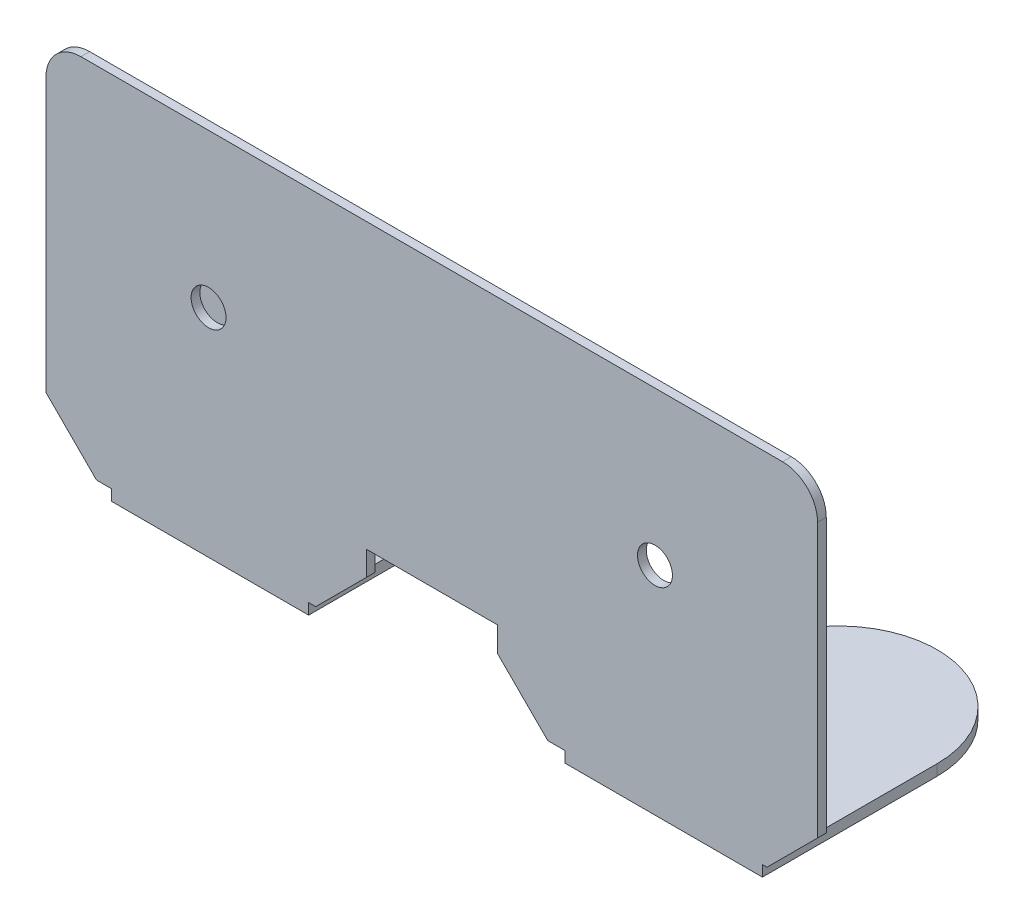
ISO-10303-21;
HEADER;
FILE_DESCRIPTION(('STEP AP214'),'2;1');
FILE_NAME('part.step','',(''),(''),'','','');
FILE_SCHEMA(('AUTOMOTIVE_DESIGN { 1 0 10303 214 1 1 1 1 }'));
ENDSEC;
DATA;
#1=APPLICATION_CONTEXT('core data for automotive mechanical design processes');
#2=APPLICATION_PROTOCOL_DEFINITION('international standard','automotive_design',2000,#1);
#3=PRODUCT_CONTEXT('',#1,'mechanical');
#4=PRODUCT('Part','Part','',(#3));
#5=PRODUCT_RELATED_PRODUCT_CATEGORY('part','',(#4));
#6=PRODUCT_DEFINITION_FORMATION('','',#4);
#7=PRODUCT_DEFINITION_CONTEXT('part definition',#1,'design');
#8=PRODUCT_DEFINITION('design','',#6,#7);
#9=PRODUCT_DEFINITION_SHAPE('','',#8);
#10=(LENGTH_UNIT() NAMED_UNIT(*) SI_UNIT(.MILLI.,.METRE.));
#11=(NAMED_UNIT(*) PLANE_ANGLE_UNIT() SI_UNIT($,.RADIAN.));
#12=(NAMED_UNIT(*) SI_UNIT($,.STERADIAN.) SOLID_ANGLE_UNIT());
#13=UNCERTAINTY_MEASURE_WITH_UNIT(LENGTH_MEASURE(1.E-05),#10,'distance_accuracy_value','');
#14=(GEOMETRIC_REPRESENTATION_CONTEXT(3) GLOBAL_UNCERTAINTY_ASSIGNED_CONTEXT((#13)) GLOBAL_UNIT_ASSIGNED_CONTEXT((#10,
#11,#12)) REPRESENTATION_CONTEXT('',''));
#15=CARTESIAN_POINT('',(0.,0.,0.));
#16=DIRECTION('',(0.,0.,1.));
#17=DIRECTION('',(1.,0.,0.));
#18=AXIS2_PLACEMENT_3D('',#15,#16,#17);
#19=CARTESIAN_POINT('',(-6.63134088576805,-1.71953510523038,0.2));
#20=DIRECTION('',(0.,1.,0.));
#21=DIRECTION('',(-1.,0.,0.));
#22=AXIS2_PLACEMENT_3D('',#19,#20,#21);
#23=PLANE('',#22);
#24=DIRECTION('',(0.,0.,1.));
#25=VECTOR('',#24,1.);
#26=CARTESIAN_POINT('',(-1.77323404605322,-1.71953510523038,0.200000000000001));
#27=LINE('',#26,#25);
#28=CARTESIAN_POINT('',(-1.77323404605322,-1.71953510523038,0.));
#29=VERTEX_POINT('',#28);
#30=CARTESIAN_POINT('',(-1.77323404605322,-1.71953510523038,0.2));
#31=VERTEX_POINT('',#30);
#32=EDGE_CURVE('E11',#29,#31,#27,.T.);
#33=ORIENTED_EDGE('',*,*,#32,.F.);
#34=DIRECTION('',(1.,0.,0.));
#35=VECTOR('',#34,1.);
#36=CARTESIAN_POINT('',(-6.63134088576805,-1.71953510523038,0.));
#37=LINE('',#36,#35);
#38=CARTESIAN_POINT('',(-1.61124963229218,-1.71953510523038,0.));
#39=VERTEX_POINT('',#38);
#40=EDGE_CURVE('E296',#29,#39,#37,.T.);
#41=ORIENTED_EDGE('',*,*,#40,.T.);
#42=DIRECTION('',(0.,0.,-1.));
#43=VECTOR('',#42,1.);
#44=CARTESIAN_POINT('',(-1.61124963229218,-1.71953510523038,0.2));
#45=LINE('',#44,#43);
#46=CARTESIAN_POINT('',(-1.61124963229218,-1.71953510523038,0.2));
#47=VERTEX_POINT('',#46);
#48=EDGE_CURVE('E354',#47,#39,#45,.T.);
#49=ORIENTED_EDGE('',*,*,#48,.F.);
#50=DIRECTION('',(1.,0.,0.));
#51=VECTOR('',#50,1.);
#52=CARTESIAN_POINT('',(-6.63134088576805,-1.71953510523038,0.2));
#53=LINE('',#52,#51);
#54=EDGE_CURVE('E41',#31,#47,#53,.T.);
#55=ORIENTED_EDGE('',*,*,#54,.F.);
#56=EDGE_LOOP('',(#33,#41,#49,#55));
#57=FACE_BOUND('',#56,.T.);
#58=ADVANCED_FACE('F26',(#57),#23,.F.);
#59=DIRECTION('',(0.,0.,-1.));
#60=VECTOR('',#59,1.);
#61=CARTESIAN_POINT('',(-6.29397223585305,-1.71953510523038,0.199999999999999));
#62=LINE('',#61,#60);
#63=CARTESIAN_POINT('',(-6.29397223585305,-1.71953510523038,0.2));
#64=VERTEX_POINT('',#63);
#65=CARTESIAN_POINT('',(-6.29397223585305,-1.71953510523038,0.));
#66=VERTEX_POINT('',#65);
#67=EDGE_CURVE('E48',#64,#66,#62,.T.);
#68=ORIENTED_EDGE('',*,*,#67,.F.);
#69=CARTESIAN_POINT('',(-6.63134088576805,-1.71953510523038,0.2));
#70=VERTEX_POINT('',#69);
#71=EDGE_CURVE('E327',#70,#64,#53,.T.);
#72=ORIENTED_EDGE('',*,*,#71,.F.);
#73=DIRECTION('',(0.,0.,-1.));
#74=VECTOR('',#73,1.);
#75=CARTESIAN_POINT('',(-6.63134088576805,-1.71953510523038,0.2));
#76=LINE('',#75,#74);
#77=CARTESIAN_POINT('',(-6.63134088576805,-1.71953510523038,0.));
#78=VERTEX_POINT('',#77);
#79=EDGE_CURVE('E357',#70,#78,#76,.T.);
#80=ORIENTED_EDGE('',*,*,#79,.T.);
#81=EDGE_CURVE('E297',#78,#66,#37,.T.);
#82=ORIENTED_EDGE('',*,*,#81,.T.);
#83=EDGE_LOOP('',(#68,#72,#80,#82));
#84=FACE_BOUND('',#83,.T.);
#85=ADVANCED_FACE('F494',(#84),#23,.F.);
#86=CARTESIAN_POINT('',(8.72284317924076,-1.71953510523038,0.2));
#87=DIRECTION('',(0.,1.,0.));
#88=DIRECTION('',(-1.,0.,0.));
#89=AXIS2_PLACEMENT_3D('',#86,#87,#88);
#90=PLANE('',#89);
#91=DIRECTION('',(0.,0.,-1.));
#92=VECTOR('',#91,1.);
#93=CARTESIAN_POINT('',(4.09331264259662,-1.71953510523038,0.2));
#94=LINE('',#93,#92);
#95=CARTESIAN_POINT('',(4.09331264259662,-1.71953510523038,0.2));
#96=VERTEX_POINT('',#95);
#97=CARTESIAN_POINT('',(4.09331264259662,-1.71953510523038,0.));
#98=VERTEX_POINT('',#97);
#99=EDGE_CURVE('E230',#96,#98,#94,.T.);
#100=ORIENTED_EDGE('',*,*,#99,.F.);
#101=DIRECTION('',(1.,0.,0.));
#102=VECTOR('',#101,1.);
#103=CARTESIAN_POINT('',(8.72284317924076,-1.71953510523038,0.2));
#104=LINE('',#103,#102);
#105=CARTESIAN_POINT('',(3.70275192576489,-1.71953510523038,0.2));
#106=VERTEX_POINT('',#105);
#107=EDGE_CURVE('E310',#106,#96,#104,.T.);
#108=ORIENTED_EDGE('',*,*,#107,.F.);
#109=DIRECTION('',(0.,0.,-1.));
#110=VECTOR('',#109,1.);
#111=CARTESIAN_POINT('',(3.70275192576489,-1.71953510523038,0.2));
#112=LINE('',#111,#110);
#113=CARTESIAN_POINT('',(3.70275192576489,-1.71953510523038,0.));
#114=VERTEX_POINT('',#113);
#115=EDGE_CURVE('E339',#106,#114,#112,.T.);
#116=ORIENTED_EDGE('',*,*,#115,.T.);
#117=DIRECTION('',(1.,0.,0.));
#118=VECTOR('',#117,1.);
#119=CARTESIAN_POINT('',(8.72284317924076,-1.71953510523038,0.));
#120=LINE('',#119,#118);
#121=EDGE_CURVE('E278',#114,#98,#120,.T.);
#122=ORIENTED_EDGE('',*,*,#121,.T.);
#123=EDGE_LOOP('',(#100,#108,#116,#122));
#124=FACE_BOUND('',#123,.T.);
#125=ADVANCED_FACE('F28',(#124),#90,.F.);
#126=DIRECTION('',(0.,0.,1.));
#127=VECTOR('',#126,1.);
#128=CARTESIAN_POINT('',(8.61797926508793,-1.71953510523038,0.2));
#129=LINE('',#128,#127);
#130=CARTESIAN_POINT('',(8.61797926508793,-1.71953510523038,0.));
#131=VERTEX_POINT('',#130);
#132=CARTESIAN_POINT('',(8.61797926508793,-1.71953510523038,0.2));
#133=VERTEX_POINT('',#132);
#134=EDGE_CURVE('E34',#131,#133,#129,.T.);
#135=ORIENTED_EDGE('',*,*,#134,.F.);
#136=CARTESIAN_POINT('',(8.72284317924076,-1.71953510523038,0.));
#137=VERTEX_POINT('',#136);
#138=EDGE_CURVE('E277',#131,#137,#120,.T.);
#139=ORIENTED_EDGE('',*,*,#138,.T.);
#140=DIRECTION('',(0.,0.,-1.));
#141=VECTOR('',#140,1.);
#142=CARTESIAN_POINT('',(8.72284317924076,-1.71953510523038,0.2));
#143=LINE('',#142,#141);
#144=CARTESIAN_POINT('',(8.72284317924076,-1.71953510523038,0.2));
#145=VERTEX_POINT('',#144);
#146=EDGE_CURVE('E378',#145,#137,#143,.T.);
#147=ORIENTED_EDGE('',*,*,#146,.F.);
#148=EDGE_CURVE('E309',#133,#145,#104,.T.);
#149=ORIENTED_EDGE('',*,*,#148,.F.);
#150=EDGE_LOOP('',(#135,#139,#147,#149));
#151=FACE_BOUND('',#150,.T.);
#152=ADVANCED_FACE('F409',(#151),#90,.F.);
#153=CARTESIAN_POINT('',(-6.98834166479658,5.7,0.));
#154=DIRECTION('',(0.,0.,-1.));
#155=DIRECTION('',(-1.,0.,0.));
#156=AXIS2_PLACEMENT_3D('',#153,#154,#155);
#157=PLANE('',#156);
#158=ORIENTED_EDGE('',*,*,#121,.F.);
#159=DIRECTION('',(0.707106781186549,-0.707106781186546,0.));
#160=VECTOR('',#159,1.);
#161=CARTESIAN_POINT('',(3.70275192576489,-1.71953510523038,0.));
#162=LINE('',#161,#160);
#163=CARTESIAN_POINT('',(2.54575114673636,-0.562534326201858,0.));
#164=VERTEX_POINT('',#163);
#165=EDGE_CURVE('E307',#164,#114,#162,.T.);
#166=ORIENTED_EDGE('',*,*,#165,.F.);
#167=DIRECTION('',(0.,-1.,0.));
#168=VECTOR('',#167,1.);
#169=CARTESIAN_POINT('',(2.54575114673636,-0.562534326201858,0.));
#170=LINE('',#169,#168);
#171=CARTESIAN_POINT('',(2.54575114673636,0.,0.));
#172=VERTEX_POINT('',#171);
#173=EDGE_CURVE('E305',#172,#164,#170,.T.);
#174=ORIENTED_EDGE('',*,*,#173,.F.);
#175=DIRECTION('',(1.,0.,0.));
#176=VECTOR('',#175,1.);
#177=CARTESIAN_POINT('',(2.54575114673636,0.,0.));
#178=LINE('',#177,#176);
#179=CARTESIAN_POINT('',(-0.454248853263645,0.,0.));
#180=VERTEX_POINT('',#179);
#181=EDGE_CURVE('E303',#180,#172,#178,.T.);
#182=ORIENTED_EDGE('',*,*,#181,.F.);
#183=DIRECTION('',(0.,1.,0.));
#184=VECTOR('',#183,1.);
#185=CARTESIAN_POINT('',(-0.454248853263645,-0.562534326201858,0.));
#186=LINE('',#185,#184);
#187=CARTESIAN_POINT('',(-0.454248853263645,-0.562534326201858,0.));
#188=VERTEX_POINT('',#187);
#189=EDGE_CURVE('E301',#188,#180,#186,.T.);
#190=ORIENTED_EDGE('',*,*,#189,.F.);
#191=DIRECTION('',(0.707106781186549,0.707106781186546,0.));
#192=VECTOR('',#191,1.);
#193=CARTESIAN_POINT('',(-1.61124963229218,-1.71953510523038,0.));
#194=LINE('',#193,#192);
#195=EDGE_CURVE('E299',#39,#188,#194,.T.);
#196=ORIENTED_EDGE('',*,*,#195,.F.);
#197=ORIENTED_EDGE('',*,*,#40,.F.);
#198=EDGE_CURVE('E195',#66,#29,#37,.T.);
#199=ORIENTED_EDGE('',*,*,#198,.F.);
#200=ORIENTED_EDGE('',*,*,#81,.F.);
#201=DIRECTION('',(0.707106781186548,-0.707106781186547,0.));
#202=VECTOR('',#201,1.);
#203=CARTESIAN_POINT('',(-7.78834166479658,-0.562534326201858,0.));
#204=LINE('',#203,#202);
#205=CARTESIAN_POINT('',(-7.78834166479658,-0.562534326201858,0.));
#206=VERTEX_POINT('',#205);
#207=EDGE_CURVE('E294',#206,#78,#204,.T.);
#208=ORIENTED_EDGE('',*,*,#207,.F.);
#209=DIRECTION('',(0.,-1.,0.));
#210=VECTOR('',#209,1.);
#211=CARTESIAN_POINT('',(-7.78834166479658,-0.562534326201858,0.));
#212=LINE('',#211,#210);
#213=CARTESIAN_POINT('',(-7.78834166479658,5.7,0.));
#214=VERTEX_POINT('',#213);
#215=EDGE_CURVE('E292',#214,#206,#212,.T.);
#216=ORIENTED_EDGE('',*,*,#215,.F.);
#217=CARTESIAN_POINT('',(-6.98834166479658,5.7,0.));
#218=DIRECTION('',(0.,0.,1.));
#219=DIRECTION('',(-1.,0.,0.));
#220=AXIS2_PLACEMENT_3D('',#217,#218,#219);
#221=CIRCLE('',#220,0.800000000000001);
#222=CARTESIAN_POINT('',(-6.98834166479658,6.5,0.));
#223=VERTEX_POINT('',#222);
#224=EDGE_CURVE('E290',#223,#214,#221,.T.);
#225=ORIENTED_EDGE('',*,*,#224,.F.);
#226=DIRECTION('',(-1.,0.,0.));
#227=VECTOR('',#226,1.);
#228=CARTESIAN_POINT('',(9.07984395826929,6.5,0.));
#229=LINE('',#228,#227);
#230=CARTESIAN_POINT('',(9.07984395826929,6.5,0.));
#231=VERTEX_POINT('',#230);
#232=EDGE_CURVE('E288',#231,#223,#229,.T.);
#233=ORIENTED_EDGE('',*,*,#232,.F.);
#234=CARTESIAN_POINT('',(9.07984395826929,5.7,0.));
#235=DIRECTION('',(0.,0.,1.));
#236=DIRECTION('',(1.,0.,0.));
#237=AXIS2_PLACEMENT_3D('',#234,#235,#236);
#238=CIRCLE('',#237,0.800000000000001);
#239=CARTESIAN_POINT('',(9.87984395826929,5.7,0.));
#240=VERTEX_POINT('',#239);
#241=EDGE_CURVE('E286',#240,#231,#238,.T.);
#242=ORIENTED_EDGE('',*,*,#241,.F.);
#243=DIRECTION('',(0.,1.,0.));
#244=VECTOR('',#243,1.);
#245=CARTESIAN_POINT('',(9.87984395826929,-0.562534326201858,0.));
#246=LINE('',#245,#244);
#247=CARTESIAN_POINT('',(9.87984395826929,-0.562534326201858,0.));
#248=VERTEX_POINT('',#247);
#249=EDGE_CURVE('E284',#248,#240,#246,.T.);
#250=ORIENTED_EDGE('',*,*,#249,.F.);
#251=DIRECTION('',(0.707106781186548,0.707106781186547,0.));
#252=VECTOR('',#251,1.);
#253=CARTESIAN_POINT('',(9.87984395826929,-0.562534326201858,0.));
#254=LINE('',#253,#252);
#255=EDGE_CURVE('E281',#137,#248,#254,.T.);
#256=ORIENTED_EDGE('',*,*,#255,.F.);
#257=ORIENTED_EDGE('',*,*,#138,.F.);
#258=EDGE_CURVE('E282',#98,#131,#120,.T.);
#259=ORIENTED_EDGE('',*,*,#258,.F.);
#260=EDGE_LOOP('',(#158,#166,#174,#182,#190,#196,#197,#199,#200,#208,#216,#225,#233,#242,#250,
#256,#257,#259));
#261=FACE_BOUND('',#260,.T.);
#262=CARTESIAN_POINT('',(6.1573017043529,2.98516921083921,0.));
#263=DIRECTION('',(0.,0.,1.));
#264=DIRECTION('',(1.,0.,0.));
#265=AXIS2_PLACEMENT_3D('',#262,#263,#264);
#266=CIRCLE('',#265,0.400000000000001);
#267=CARTESIAN_POINT('',(6.5573017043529,2.98516921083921,0.));
#268=VERTEX_POINT('',#267);
#269=EDGE_CURVE('E271',#268,#268,#266,.T.);
#270=ORIENTED_EDGE('',*,*,#269,.T.);
#271=EDGE_LOOP('',(#270));
#272=FACE_BOUND('',#271,.T.);
#273=CARTESIAN_POINT('',(-4.06579941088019,2.98516921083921,0.));
#274=DIRECTION('',(0.,0.,-1.));
#275=DIRECTION('',(-1.,0.,0.));
#276=AXIS2_PLACEMENT_3D('',#273,#274,#275);
#277=CIRCLE('',#276,1.95051203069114);
#278=CARTESIAN_POINT('',(-6.01631144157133,2.98516921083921,0.));
#279=VERTEX_POINT('',#278);
#280=EDGE_CURVE('E259',#279,#279,#277,.T.);
#281=ORIENTED_EDGE('',*,*,#280,.F.);
#282=EDGE_LOOP('',(#281));
#283=FACE_BOUND('',#282,.T.);
#284=ADVANCED_FACE('F411',(#261,#272,#283),#157,.T.);
#285=CARTESIAN_POINT('',(-6.98834166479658,5.7,0.2));
#286=DIRECTION('',(0.,0.,-1.));
#287=DIRECTION('',(-1.,0.,0.));
#288=AXIS2_PLACEMENT_3D('',#285,#286,#287);
#289=PLANE('',#288);
#290=CARTESIAN_POINT('',(6.1573017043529,2.98516921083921,0.2));
#291=DIRECTION('',(0.,0.,1.));
#292=DIRECTION('',(1.,0.,0.));
#293=AXIS2_PLACEMENT_3D('',#290,#291,#292);
#294=CIRCLE('',#293,0.400000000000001);
#295=CARTESIAN_POINT('',(6.5573017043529,2.98516921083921,0.2));
#296=VERTEX_POINT('',#295);
#297=EDGE_CURVE('E274',#296,#296,#294,.T.);
#298=ORIENTED_EDGE('',*,*,#297,.F.);
#299=EDGE_LOOP('',(#298));
#300=FACE_BOUND('',#299,.T.);
#301=ORIENTED_EDGE('',*,*,#107,.T.);
#302=DIRECTION('',(0.,1.,0.));
#303=VECTOR('',#302,1.);
#304=CARTESIAN_POINT('',(4.09331264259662,-1.96953510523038,0.2));
#305=LINE('',#304,#303);
#306=CARTESIAN_POINT('',(4.09331264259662,-1.96953510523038,0.2));
#307=VERTEX_POINT('',#306);
#308=EDGE_CURVE('E256',#307,#96,#305,.T.);
#309=ORIENTED_EDGE('',*,*,#308,.F.);
#310=DIRECTION('',(-1.,0.,0.));
#311=VECTOR('',#310,1.);
#312=CARTESIAN_POINT('',(8.61797926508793,-1.96953510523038,0.2));
#313=LINE('',#312,#311);
#314=CARTESIAN_POINT('',(8.61797926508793,-1.96953510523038,0.2));
#315=VERTEX_POINT('',#314);
#316=EDGE_CURVE('E238',#315,#307,#313,.T.);
#317=ORIENTED_EDGE('',*,*,#316,.F.);
#318=DIRECTION('',(0.,1.,0.));
#319=VECTOR('',#318,1.);
#320=CARTESIAN_POINT('',(8.61797926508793,-1.96953510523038,0.2));
#321=LINE('',#320,#319);
#322=EDGE_CURVE('E247',#315,#133,#321,.T.);
#323=ORIENTED_EDGE('',*,*,#322,.T.);
#324=ORIENTED_EDGE('',*,*,#148,.T.);
#325=DIRECTION('',(0.707106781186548,0.707106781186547,0.));
#326=VECTOR('',#325,1.);
#327=CARTESIAN_POINT('',(9.87984395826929,-0.562534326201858,0.2));
#328=LINE('',#327,#326);
#329=CARTESIAN_POINT('',(9.87984395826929,-0.562534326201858,0.2));
#330=VERTEX_POINT('',#329);
#331=EDGE_CURVE('E313',#145,#330,#328,.T.);
#332=ORIENTED_EDGE('',*,*,#331,.T.);
#333=DIRECTION('',(0.,1.,0.));
#334=VECTOR('',#333,1.);
#335=CARTESIAN_POINT('',(9.87984395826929,-0.562534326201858,0.2));
#336=LINE('',#335,#334);
#337=CARTESIAN_POINT('',(9.87984395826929,5.7,0.2));
#338=VERTEX_POINT('',#337);
#339=EDGE_CURVE('E315',#330,#338,#336,.T.);
#340=ORIENTED_EDGE('',*,*,#339,.T.);
#341=CARTESIAN_POINT('',(9.07984395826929,5.7,0.2));
#342=DIRECTION('',(0.,0.,1.));
#343=DIRECTION('',(1.,0.,0.));
#344=AXIS2_PLACEMENT_3D('',#341,#342,#343);
#345=CIRCLE('',#344,0.800000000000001);
#346=CARTESIAN_POINT('',(9.07984395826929,6.5,0.2));
#347=VERTEX_POINT('',#346);
#348=EDGE_CURVE('E317',#338,#347,#345,.T.);
#349=ORIENTED_EDGE('',*,*,#348,.T.);
#350=DIRECTION('',(-1.,0.,0.));
#351=VECTOR('',#350,1.);
#352=CARTESIAN_POINT('',(9.07984395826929,6.5,0.2));
#353=LINE('',#352,#351);
#354=CARTESIAN_POINT('',(-6.98834166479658,6.5,0.2));
#355=VERTEX_POINT('',#354);
#356=EDGE_CURVE('E319',#347,#355,#353,.T.);
#357=ORIENTED_EDGE('',*,*,#356,.T.);
#358=CARTESIAN_POINT('',(-6.98834166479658,5.7,0.2));
#359=DIRECTION('',(0.,0.,1.));
#360=DIRECTION('',(-1.,0.,0.));
#361=AXIS2_PLACEMENT_3D('',#358,#359,#360);
#362=CIRCLE('',#361,0.800000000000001);
#363=CARTESIAN_POINT('',(-7.78834166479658,5.7,0.2));
#364=VERTEX_POINT('',#363);
#365=EDGE_CURVE('E321',#355,#364,#362,.T.);
#366=ORIENTED_EDGE('',*,*,#365,.T.);
#367=DIRECTION('',(0.,-1.,0.));
#368=VECTOR('',#367,1.);
#369=CARTESIAN_POINT('',(-7.78834166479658,-0.562534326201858,0.2));
#370=LINE('',#369,#368);
#371=CARTESIAN_POINT('',(-7.78834166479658,-0.562534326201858,0.2));
#372=VERTEX_POINT('',#371);
#373=EDGE_CURVE('E323',#364,#372,#370,.T.);
#374=ORIENTED_EDGE('',*,*,#373,.T.);
#375=DIRECTION('',(0.707106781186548,-0.707106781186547,0.));
#376=VECTOR('',#375,1.);
#377=CARTESIAN_POINT('',(-7.78834166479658,-0.562534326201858,0.2));
#378=LINE('',#377,#376);
#379=EDGE_CURVE('E325',#372,#70,#378,.T.);
#380=ORIENTED_EDGE('',*,*,#379,.T.);
#381=ORIENTED_EDGE('',*,*,#71,.T.);
#382=DIRECTION('',(0.,1.,0.));
#383=VECTOR('',#382,1.);
#384=CARTESIAN_POINT('',(-6.29397223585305,-1.96953510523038,0.199999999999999));
#385=LINE('',#384,#383);
#386=CARTESIAN_POINT('',(-6.29397223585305,-1.96953510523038,0.199999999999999));
#387=VERTEX_POINT('',#386);
#388=EDGE_CURVE('E225',#387,#64,#385,.T.);
#389=ORIENTED_EDGE('',*,*,#388,.F.);
#390=DIRECTION('',(-1.,0.,0.));
#391=VECTOR('',#390,1.);
#392=CARTESIAN_POINT('',(-1.77323404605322,-1.96953510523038,0.2));
#393=LINE('',#392,#391);
#394=CARTESIAN_POINT('',(-1.77323404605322,-1.96953510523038,0.2));
#395=VERTEX_POINT('',#394);
#396=EDGE_CURVE('E220',#395,#387,#393,.T.);
#397=ORIENTED_EDGE('',*,*,#396,.F.);
#398=DIRECTION('',(0.,1.,0.));
#399=VECTOR('',#398,1.);
#400=CARTESIAN_POINT('',(-1.77323404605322,-1.96953510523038,0.2));
#401=LINE('',#400,#399);
#402=EDGE_CURVE('E208',#395,#31,#401,.T.);
#403=ORIENTED_EDGE('',*,*,#402,.T.);
#404=ORIENTED_EDGE('',*,*,#54,.T.);
#405=DIRECTION('',(0.707106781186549,0.707106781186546,0.));
#406=VECTOR('',#405,1.);
#407=CARTESIAN_POINT('',(-1.61124963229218,-1.71953510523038,0.2));
#408=LINE('',#407,#406);
#409=CARTESIAN_POINT('',(-0.454248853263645,-0.562534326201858,0.2));
#410=VERTEX_POINT('',#409);
#411=EDGE_CURVE('E329',#47,#410,#408,.T.);
#412=ORIENTED_EDGE('',*,*,#411,.T.);
#413=DIRECTION('',(0.,1.,0.));
#414=VECTOR('',#413,1.);
#415=CARTESIAN_POINT('',(-0.454248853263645,-0.562534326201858,0.2));
#416=LINE('',#415,#414);
#417=CARTESIAN_POINT('',(-0.454248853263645,0.,0.2));
#418=VERTEX_POINT('',#417);
#419=EDGE_CURVE('E331',#410,#418,#416,.T.);
#420=ORIENTED_EDGE('',*,*,#419,.T.);
#421=DIRECTION('',(1.,0.,0.));
#422=VECTOR('',#421,1.);
#423=CARTESIAN_POINT('',(2.54575114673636,0.,0.2));
#424=LINE('',#423,#422);
#425=CARTESIAN_POINT('',(2.54575114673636,0.,0.2));
#426=VERTEX_POINT('',#425);
#427=EDGE_CURVE('E333',#418,#426,#424,.T.);
#428=ORIENTED_EDGE('',*,*,#427,.T.);
#429=DIRECTION('',(0.,-1.,0.));
#430=VECTOR('',#429,1.);
#431=CARTESIAN_POINT('',(2.54575114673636,-0.562534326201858,0.2));
#432=LINE('',#431,#430);
#433=CARTESIAN_POINT('',(2.54575114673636,-0.562534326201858,0.2));
#434=VERTEX_POINT('',#433);
#435=EDGE_CURVE('E335',#426,#434,#432,.T.);
#436=ORIENTED_EDGE('',*,*,#435,.T.);
#437=DIRECTION('',(0.707106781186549,-0.707106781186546,0.));
#438=VECTOR('',#437,1.);
#439=CARTESIAN_POINT('',(3.70275192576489,-1.71953510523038,0.2));
#440=LINE('',#439,#438);
#441=EDGE_CURVE('E337',#434,#106,#440,.T.);
#442=ORIENTED_EDGE('',*,*,#441,.T.);
#443=EDGE_LOOP('',(#301,#309,#317,#323,#324,#332,#340,#349,#357,#366,#374,#380,#381,#389,#397,
#403,#404,#412,#420,#428,#436,#442));
#444=FACE_BOUND('',#443,.T.);
#445=CARTESIAN_POINT('',(-4.06579941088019,2.98516921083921,0.2));
#446=DIRECTION('',(0.,0.,1.));
#447=DIRECTION('',(1.,0.,0.));
#448=AXIS2_PLACEMENT_3D('',#445,#446,#447);
#449=CIRCLE('',#448,0.4);
#450=CARTESIAN_POINT('',(-3.66579941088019,2.98516921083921,0.2));
#451=VERTEX_POINT('',#450);
#452=EDGE_CURVE('E268',#451,#451,#449,.T.);
#453=ORIENTED_EDGE('',*,*,#452,.F.);
#454=EDGE_LOOP('',(#453));
#455=FACE_BOUND('',#454,.T.);
#456=ADVANCED_FACE('F390',(#300,#444,#455),#289,.F.);
#457=CARTESIAN_POINT('',(9.87984395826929,-0.562534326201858,0.2));
#458=DIRECTION('',(-0.707106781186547,0.707106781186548,0.));
#459=DIRECTION('',(-0.707106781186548,-0.707106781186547,0.));
#460=AXIS2_PLACEMENT_3D('',#457,#458,#459);
#461=PLANE('',#460);
#462=ORIENTED_EDGE('',*,*,#255,.T.);
#463=DIRECTION('',(0.,0.,-1.));
#464=VECTOR('',#463,1.);
#465=CARTESIAN_POINT('',(9.87984395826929,-0.562534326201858,0.2));
#466=LINE('',#465,#464);
#467=EDGE_CURVE('E375',#330,#248,#466,.T.);
#468=ORIENTED_EDGE('',*,*,#467,.F.);
#469=ORIENTED_EDGE('',*,*,#331,.F.);
#470=ORIENTED_EDGE('',*,*,#146,.T.);
#471=EDGE_LOOP('',(#462,#468,#469,#470));
#472=FACE_BOUND('',#471,.T.);
#473=ADVANCED_FACE('F416',(#472),#461,.F.);
#474=CARTESIAN_POINT('',(9.87984395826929,-0.562534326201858,0.2));
#475=DIRECTION('',(-1.,0.,0.));
#476=DIRECTION('',(0.,-1.,0.));
#477=AXIS2_PLACEMENT_3D('',#474,#475,#476);
#478=PLANE('',#477);
#479=ORIENTED_EDGE('',*,*,#249,.T.);
#480=DIRECTION('',(0.,0.,-1.));
#481=VECTOR('',#480,1.);
#482=CARTESIAN_POINT('',(9.87984395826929,5.7,0.2));
#483=LINE('',#482,#481);
#484=EDGE_CURVE('E372',#338,#240,#483,.T.);
#485=ORIENTED_EDGE('',*,*,#484,.F.);
#486=ORIENTED_EDGE('',*,*,#339,.F.);
#487=ORIENTED_EDGE('',*,*,#467,.T.);
#488=EDGE_LOOP('',(#479,#485,#486,#487));
#489=FACE_BOUND('',#488,.T.);
#490=ADVANCED_FACE('F422',(#489),#478,.F.);
#491=CARTESIAN_POINT('',(9.07984395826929,5.7,0.2));
#492=DIRECTION('',(0.,0.,-1.));
#493=DIRECTION('',(-1.,0.,0.));
#494=AXIS2_PLACEMENT_3D('',#491,#492,#493);
#495=CYLINDRICAL_SURFACE('',#494,0.800000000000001);
#496=ORIENTED_EDGE('',*,*,#241,.T.);
#497=DIRECTION('',(0.,0.,-1.));
#498=VECTOR('',#497,1.);
#499=CARTESIAN_POINT('',(9.07984395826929,6.5,0.2));
#500=LINE('',#499,#498);
#501=EDGE_CURVE('E369',#347,#231,#500,.T.);
#502=ORIENTED_EDGE('',*,*,#501,.F.);
#503=ORIENTED_EDGE('',*,*,#348,.F.);
#504=ORIENTED_EDGE('',*,*,#484,.T.);
#505=EDGE_LOOP('',(#496,#502,#503,#504));
#506=FACE_BOUND('',#505,.T.);
#507=ADVANCED_FACE('F424',(#506),#495,.T.);
#508=CARTESIAN_POINT('',(9.07984395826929,6.5,0.2));
#509=DIRECTION('',(0.,-1.,0.));
#510=DIRECTION('',(0.,0.,-1.));
#511=AXIS2_PLACEMENT_3D('',#508,#509,#510);
#512=PLANE('',#511);
#513=ORIENTED_EDGE('',*,*,#232,.T.);
#514=DIRECTION('',(0.,0.,-1.));
#515=VECTOR('',#514,1.);
#516=CARTESIAN_POINT('',(-6.98834166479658,6.5,0.2));
#517=LINE('',#516,#515);
#518=EDGE_CURVE('E366',#355,#223,#517,.T.);
#519=ORIENTED_EDGE('',*,*,#518,.F.);
#520=ORIENTED_EDGE('',*,*,#356,.F.);
#521=ORIENTED_EDGE('',*,*,#501,.T.);
#522=EDGE_LOOP('',(#513,#519,#520,#521));
#523=FACE_BOUND('',#522,.T.);
#524=ADVANCED_FACE('F429',(#523),#512,.F.);
#525=CARTESIAN_POINT('',(-6.98834166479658,5.7,0.2));
#526=DIRECTION('',(0.,0.,-1.));
#527=DIRECTION('',(-1.,0.,0.));
#528=AXIS2_PLACEMENT_3D('',#525,#526,#527);
#529=CYLINDRICAL_SURFACE('',#528,0.800000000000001);
#530=ORIENTED_EDGE('',*,*,#224,.T.);
#531=DIRECTION('',(0.,0.,-1.));
#532=VECTOR('',#531,1.);
#533=CARTESIAN_POINT('',(-7.78834166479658,5.7,0.2));
#534=LINE('',#533,#532);
#535=EDGE_CURVE('E363',#364,#214,#534,.T.);
#536=ORIENTED_EDGE('',*,*,#535,.F.);
#537=ORIENTED_EDGE('',*,*,#365,.F.);
#538=ORIENTED_EDGE('',*,*,#518,.T.);
#539=EDGE_LOOP('',(#530,#536,#537,#538));
#540=FACE_BOUND('',#539,.T.);
#541=ADVANCED_FACE('F435',(#540),#529,.T.);
#542=CARTESIAN_POINT('',(-7.78834166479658,-0.562534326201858,0.2));
#543=DIRECTION('',(1.,0.,0.));
#544=DIRECTION('',(0.,1.,0.));
#545=AXIS2_PLACEMENT_3D('',#542,#543,#544);
#546=PLANE('',#545);
#547=ORIENTED_EDGE('',*,*,#215,.T.);
#548=DIRECTION('',(0.,0.,-1.));
#549=VECTOR('',#548,1.);
#550=CARTESIAN_POINT('',(-7.78834166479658,-0.562534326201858,0.2));
#551=LINE('',#550,#549);
#552=EDGE_CURVE('E360',#372,#206,#551,.T.);
#553=ORIENTED_EDGE('',*,*,#552,.F.);
#554=ORIENTED_EDGE('',*,*,#373,.F.);
#555=ORIENTED_EDGE('',*,*,#535,.T.);
#556=EDGE_LOOP('',(#547,#553,#554,#555));
#557=FACE_BOUND('',#556,.T.);
#558=ADVANCED_FACE('F439',(#557),#546,.F.);
#559=CARTESIAN_POINT('',(-7.78834166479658,-0.562534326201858,0.2));
#560=DIRECTION('',(0.707106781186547,0.707106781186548,0.));
#561=DIRECTION('',(-0.707106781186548,0.707106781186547,0.));
#562=AXIS2_PLACEMENT_3D('',#559,#560,#561);
#563=PLANE('',#562);
#564=ORIENTED_EDGE('',*,*,#207,.T.);
#565=ORIENTED_EDGE('',*,*,#79,.F.);
#566=ORIENTED_EDGE('',*,*,#379,.F.);
#567=ORIENTED_EDGE('',*,*,#552,.T.);
#568=EDGE_LOOP('',(#564,#565,#566,#567));
#569=FACE_BOUND('',#568,.T.);
#570=ADVANCED_FACE('F444',(#569),#563,.F.);
#571=CARTESIAN_POINT('',(-1.61124963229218,-1.71953510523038,0.2));
#572=DIRECTION('',(-0.707106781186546,0.707106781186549,0.));
#573=DIRECTION('',(-0.707106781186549,-0.707106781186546,0.));
#574=AXIS2_PLACEMENT_3D('',#571,#572,#573);
#575=PLANE('',#574);
#576=ORIENTED_EDGE('',*,*,#195,.T.);
#577=DIRECTION('',(0.,0.,-1.));
#578=VECTOR('',#577,1.);
#579=CARTESIAN_POINT('',(-0.454248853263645,-0.562534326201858,0.2));
#580=LINE('',#579,#578);
#581=EDGE_CURVE('E351',#410,#188,#580,.T.);
#582=ORIENTED_EDGE('',*,*,#581,.F.);
#583=ORIENTED_EDGE('',*,*,#411,.F.);
#584=ORIENTED_EDGE('',*,*,#48,.T.);
#585=EDGE_LOOP('',(#576,#582,#583,#584));
#586=FACE_BOUND('',#585,.T.);
#587=ADVANCED_FACE('F459',(#586),#575,.F.);
#588=CARTESIAN_POINT('',(-0.454248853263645,-0.562534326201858,0.2));
#589=DIRECTION('',(-1.,0.,0.));
#590=DIRECTION('',(0.,0.,1.));
#591=AXIS2_PLACEMENT_3D('',#588,#589,#590);
#592=PLANE('',#591);
#593=ORIENTED_EDGE('',*,*,#189,.T.);
#594=DIRECTION('',(0.,0.,-1.));
#595=VECTOR('',#594,1.);
#596=CARTESIAN_POINT('',(-0.454248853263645,0.,0.2));
#597=LINE('',#596,#595);
#598=EDGE_CURVE('E348',#418,#180,#597,.T.);
#599=ORIENTED_EDGE('',*,*,#598,.F.);
#600=ORIENTED_EDGE('',*,*,#419,.F.);
#601=ORIENTED_EDGE('',*,*,#581,.T.);
#602=EDGE_LOOP('',(#593,#599,#600,#601));
#603=FACE_BOUND('',#602,.T.);
#604=ADVANCED_FACE('F463',(#603),#592,.F.);
#605=CARTESIAN_POINT('',(2.54575114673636,0.,0.2));
#606=DIRECTION('',(0.,1.,0.));
#607=DIRECTION('',(0.,0.,1.));
#608=AXIS2_PLACEMENT_3D('',#605,#606,#607);
#609=PLANE('',#608);
#610=ORIENTED_EDGE('',*,*,#181,.T.);
#611=DIRECTION('',(0.,0.,-1.));
#612=VECTOR('',#611,1.);
#613=CARTESIAN_POINT('',(2.54575114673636,0.,0.2));
#614=LINE('',#613,#612);
#615=EDGE_CURVE('E345',#426,#172,#614,.T.);
#616=ORIENTED_EDGE('',*,*,#615,.F.);
#617=ORIENTED_EDGE('',*,*,#427,.F.);
#618=ORIENTED_EDGE('',*,*,#598,.T.);
#619=EDGE_LOOP('',(#610,#616,#617,#618));
#620=FACE_BOUND('',#619,.T.);
#621=ADVANCED_FACE('F470',(#620),#609,.F.);
#622=CARTESIAN_POINT('',(2.54575114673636,-0.562534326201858,0.2));
#623=DIRECTION('',(1.,0.,0.));
#624=DIRECTION('',(0.,0.,-1.));
#625=AXIS2_PLACEMENT_3D('',#622,#623,#624);
#626=PLANE('',#625);
#627=ORIENTED_EDGE('',*,*,#173,.T.);
#628=DIRECTION('',(0.,0.,-1.));
#629=VECTOR('',#628,1.);
#630=CARTESIAN_POINT('',(2.54575114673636,-0.562534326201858,0.2));
#631=LINE('',#630,#629);
#632=EDGE_CURVE('E342',#434,#164,#631,.T.);
#633=ORIENTED_EDGE('',*,*,#632,.F.);
#634=ORIENTED_EDGE('',*,*,#435,.F.);
#635=ORIENTED_EDGE('',*,*,#615,.T.);
#636=EDGE_LOOP('',(#627,#633,#634,#635));
#637=FACE_BOUND('',#636,.T.);
#638=ADVANCED_FACE('F473',(#637),#626,.F.);
#639=CARTESIAN_POINT('',(3.70275192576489,-1.71953510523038,0.2));
#640=DIRECTION('',(0.707106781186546,0.707106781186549,0.));
#641=DIRECTION('',(-0.707106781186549,0.707106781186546,0.));
#642=AXIS2_PLACEMENT_3D('',#639,#640,#641);
#643=PLANE('',#642);
#644=ORIENTED_EDGE('',*,*,#165,.T.);
#645=ORIENTED_EDGE('',*,*,#115,.F.);
#646=ORIENTED_EDGE('',*,*,#441,.F.);
#647=ORIENTED_EDGE('',*,*,#632,.T.);
#648=EDGE_LOOP('',(#644,#645,#646,#647));
#649=FACE_BOUND('',#648,.T.);
#650=ADVANCED_FACE('F478',(#649),#643,.F.);
#651=CARTESIAN_POINT('',(6.1573017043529,2.98516921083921,0.2));
#652=DIRECTION('',(0.,0.,-1.));
#653=DIRECTION('',(-1.,0.,0.));
#654=AXIS2_PLACEMENT_3D('',#651,#652,#653);
#655=CYLINDRICAL_SURFACE('',#654,0.400000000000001);
#656=ORIENTED_EDGE('',*,*,#297,.T.);
#657=EDGE_LOOP('',(#656));
#658=FACE_BOUND('',#657,.T.);
#659=ORIENTED_EDGE('',*,*,#269,.F.);
#660=EDGE_LOOP('',(#659));
#661=FACE_BOUND('',#660,.T.);
#662=ADVANCED_FACE('F529',(#658,#661),#655,.F.);
#663=CARTESIAN_POINT('',(-4.06579941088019,2.98516921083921,0.2));
#664=DIRECTION('',(0.,0.,-1.));
#665=DIRECTION('',(-1.,0.,0.));
#666=AXIS2_PLACEMENT_3D('',#663,#664,#665);
#667=CYLINDRICAL_SURFACE('',#666,0.4);
#668=ORIENTED_EDGE('',*,*,#452,.T.);
#669=EDGE_LOOP('',(#668));
#670=FACE_BOUND('',#669,.T.);
#671=CARTESIAN_POINT('',(-4.06579941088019,2.98516921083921,0.));
#672=DIRECTION('',(0.,0.,1.));
#673=DIRECTION('',(1.,0.,0.));
#674=AXIS2_PLACEMENT_3D('',#671,#672,#673);
#675=CIRCLE('',#674,0.4);
#676=CARTESIAN_POINT('',(-3.66579941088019,2.98516921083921,0.));
#677=VERTEX_POINT('',#676);
#678=EDGE_CURVE('E265',#677,#677,#675,.T.);
#679=ORIENTED_EDGE('',*,*,#678,.F.);
#680=EDGE_LOOP('',(#679));
#681=FACE_BOUND('',#680,.T.);
#682=ADVANCED_FACE('F612',(#670,#681),#667,.F.);
#683=CARTESIAN_POINT('',(-4.06579941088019,2.98516921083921,0.));
#684=DIRECTION('',(0.,0.,-1.));
#685=DIRECTION('',(-1.,0.,0.));
#686=AXIS2_PLACEMENT_3D('',#683,#684,#685);
#687=PLANE('',#686);
#688=ORIENTED_EDGE('',*,*,#678,.T.);
#689=EDGE_LOOP('',(#688));
#690=FACE_BOUND('',#689,.T.);
#691=ADVANCED_FACE('F604',(#690),#687,.F.);
#692=CARTESIAN_POINT('',(-4.06579941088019,2.98516921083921,0.));
#693=DIRECTION('',(0.,0.,1.));
#694=DIRECTION('',(-1.,0.,0.));
#695=AXIS2_PLACEMENT_3D('',#692,#693,#694);
#696=CONICAL_SURFACE('',#695,1.95051203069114,0.78539816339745);
#697=CARTESIAN_POINT('',(-4.06579941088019,2.98516921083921,-0.3));
#698=DIRECTION('',(0.,0.,-1.));
#699=DIRECTION('',(-1.,0.,0.));
#700=AXIS2_PLACEMENT_3D('',#697,#698,#699);
#701=CIRCLE('',#700,1.65051203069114);
#702=CARTESIAN_POINT('',(-5.71631144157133,2.98516921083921,-0.3));
#703=VERTEX_POINT('',#702);
#704=EDGE_CURVE('E262',#703,#703,#701,.T.);
#705=ORIENTED_EDGE('',*,*,#704,.F.);
#706=EDGE_LOOP('',(#705));
#707=FACE_BOUND('',#706,.T.);
#708=ORIENTED_EDGE('',*,*,#280,.T.);
#709=EDGE_LOOP('',(#708));
#710=FACE_BOUND('',#709,.T.);
#711=ADVANCED_FACE('F596',(#707,#710),#696,.T.);
#712=CARTESIAN_POINT('',(-4.06579941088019,2.98516921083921,-0.3));
#713=DIRECTION('',(0.,0.,-1.));
#714=DIRECTION('',(-1.,0.,0.));
#715=AXIS2_PLACEMENT_3D('',#712,#713,#714);
#716=PLANE('',#715);
#717=ORIENTED_EDGE('',*,*,#704,.T.);
#718=EDGE_LOOP('',(#717));
#719=FACE_BOUND('',#718,.T.);
#720=ADVANCED_FACE('F491',(#719),#716,.T.);
#721=CARTESIAN_POINT('',(4.09331264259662,-1.96953510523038,0.2));
#722=DIRECTION('',(1.,0.,0.));
#723=DIRECTION('',(0.,0.,-1.));
#724=AXIS2_PLACEMENT_3D('',#721,#722,#723);
#725=PLANE('',#724);
#726=ORIENTED_EDGE('',*,*,#99,.T.);
#727=CARTESIAN_POINT('',(4.09331264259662,-1.71953510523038,-3.80082444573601));
#728=VERTEX_POINT('',#727);
#729=EDGE_CURVE('E207',#98,#728,#94,.T.);
#730=ORIENTED_EDGE('',*,*,#729,.T.);
#731=DIRECTION('',(0.,1.,0.));
#732=VECTOR('',#731,1.);
#733=CARTESIAN_POINT('',(4.09331264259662,-1.96953510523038,-3.80082444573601));
#734=LINE('',#733,#732);
#735=CARTESIAN_POINT('',(4.09331264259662,-1.96953510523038,-3.80082444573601));
#736=VERTEX_POINT('',#735);
#737=EDGE_CURVE('E253',#736,#728,#734,.T.);
#738=ORIENTED_EDGE('',*,*,#737,.F.);
#739=DIRECTION('',(0.,0.,-1.));
#740=VECTOR('',#739,1.);
#741=CARTESIAN_POINT('',(4.09331264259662,-1.96953510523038,0.2));
#742=LINE('',#741,#740);
#743=EDGE_CURVE('E241',#307,#736,#742,.T.);
#744=ORIENTED_EDGE('',*,*,#743,.F.);
#745=ORIENTED_EDGE('',*,*,#308,.T.);
#746=EDGE_LOOP('',(#726,#730,#738,#744,#745));
#747=FACE_BOUND('',#746,.T.);
#748=ADVANCED_FACE('F482',(#747),#725,.F.);
#749=CARTESIAN_POINT('',(6.35564595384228,-1.96953510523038,-3.80082444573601));
#750=DIRECTION('',(0.,1.,0.));
#751=DIRECTION('',(0.,0.,1.));
#752=AXIS2_PLACEMENT_3D('',#749,#750,#751);
#753=CYLINDRICAL_SURFACE('',#752,2.26233331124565);
#754=CARTESIAN_POINT('',(6.35564595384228,-1.71953510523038,-3.80082444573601));
#755=DIRECTION('',(0.,-1.,0.));
#756=DIRECTION('',(0.,0.,1.));
#757=AXIS2_PLACEMENT_3D('',#754,#755,#756);
#758=CIRCLE('',#757,2.26233331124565);
#759=CARTESIAN_POINT('',(8.61797926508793,-1.71953510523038,-3.80082444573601));
#760=VERTEX_POINT('',#759);
#761=EDGE_CURVE('E233',#728,#760,#758,.T.);
#762=ORIENTED_EDGE('',*,*,#761,.T.);
#763=DIRECTION('',(0.,1.,0.));
#764=VECTOR('',#763,1.);
#765=CARTESIAN_POINT('',(8.61797926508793,-1.96953510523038,-3.80082444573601));
#766=LINE('',#765,#764);
#767=CARTESIAN_POINT('',(8.61797926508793,-1.96953510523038,-3.80082444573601));
#768=VERTEX_POINT('',#767);
#769=EDGE_CURVE('E250',#768,#760,#766,.T.);
#770=ORIENTED_EDGE('',*,*,#769,.F.);
#771=CARTESIAN_POINT('',(6.35564595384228,-1.96953510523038,-3.80082444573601));
#772=DIRECTION('',(0.,-1.,0.));
#773=DIRECTION('',(0.,0.,1.));
#774=AXIS2_PLACEMENT_3D('',#771,#772,#773);
#775=CIRCLE('',#774,2.26233331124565);
#776=EDGE_CURVE('E243',#736,#768,#775,.T.);
#777=ORIENTED_EDGE('',*,*,#776,.F.);
#778=ORIENTED_EDGE('',*,*,#737,.T.);
#779=EDGE_LOOP('',(#762,#770,#777,#778));
#780=FACE_BOUND('',#779,.T.);
#781=ADVANCED_FACE('F483',(#780),#753,.T.);
#782=CARTESIAN_POINT('',(8.61797926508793,-1.96953510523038,0.2));
#783=DIRECTION('',(-1.,0.,0.));
#784=DIRECTION('',(0.,0.,1.));
#785=AXIS2_PLACEMENT_3D('',#782,#783,#784);
#786=PLANE('',#785);
#787=DIRECTION('',(0.,0.,1.));
#788=VECTOR('',#787,1.);
#789=CARTESIAN_POINT('',(8.61797926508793,-1.71953510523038,0.2));
#790=LINE('',#789,#788);
#791=EDGE_CURVE('E235',#760,#131,#790,.T.);
#792=ORIENTED_EDGE('',*,*,#791,.T.);
#793=ORIENTED_EDGE('',*,*,#134,.T.);
#794=ORIENTED_EDGE('',*,*,#322,.F.);
#795=DIRECTION('',(0.,0.,1.));
#796=VECTOR('',#795,1.);
#797=CARTESIAN_POINT('',(8.61797926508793,-1.96953510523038,0.2));
#798=LINE('',#797,#796);
#799=EDGE_CURVE('E245',#768,#315,#798,.T.);
#800=ORIENTED_EDGE('',*,*,#799,.F.);
#801=ORIENTED_EDGE('',*,*,#769,.T.);
#802=EDGE_LOOP('',(#792,#793,#794,#800,#801));
#803=FACE_BOUND('',#802,.T.);
#804=ADVANCED_FACE('F383',(#803),#786,.F.);
#805=CARTESIAN_POINT('',(6.35564595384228,-1.96953510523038,-3.80082444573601));
#806=DIRECTION('',(0.,1.,0.));
#807=DIRECTION('',(0.,0.,1.));
#808=AXIS2_PLACEMENT_3D('',#805,#806,#807);
#809=PLANE('',#808);
#810=ORIENTED_EDGE('',*,*,#316,.T.);
#811=ORIENTED_EDGE('',*,*,#743,.T.);
#812=ORIENTED_EDGE('',*,*,#776,.T.);
#813=ORIENTED_EDGE('',*,*,#799,.T.);
#814=EDGE_LOOP('',(#810,#811,#812,#813));
#815=FACE_BOUND('',#814,.T.);
#816=ADVANCED_FACE('F395',(#815),#809,.F.);
#817=CARTESIAN_POINT('',(6.35564595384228,-1.71953510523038,-3.80082444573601));
#818=DIRECTION('',(0.,1.,0.));
#819=DIRECTION('',(0.,0.,1.));
#820=AXIS2_PLACEMENT_3D('',#817,#818,#819);
#821=PLANE('',#820);
#822=ORIENTED_EDGE('',*,*,#729,.F.);
#823=ORIENTED_EDGE('',*,*,#258,.T.);
#824=ORIENTED_EDGE('',*,*,#791,.F.);
#825=ORIENTED_EDGE('',*,*,#761,.F.);
#826=EDGE_LOOP('',(#822,#823,#824,#825));
#827=FACE_BOUND('',#826,.T.);
#828=ADVANCED_FACE('F404',(#827),#821,.T.);
#829=CARTESIAN_POINT('',(-4.03360314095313,-1.96953510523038,-3.80082444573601));
#830=DIRECTION('',(0.,1.,0.));
#831=DIRECTION('',(0.,0.,1.));
#832=AXIS2_PLACEMENT_3D('',#829,#830,#831);
#833=CYLINDRICAL_SURFACE('',#832,2.26036909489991);
#834=CARTESIAN_POINT('',(-4.03360314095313,-1.71953510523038,-3.80082444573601));
#835=DIRECTION('',(0.,-1.,0.));
#836=DIRECTION('',(0.,0.,-1.));
#837=AXIS2_PLACEMENT_3D('',#834,#835,#836);
#838=CIRCLE('',#837,2.26036909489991);
#839=CARTESIAN_POINT('',(-6.29397223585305,-1.71953510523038,-3.80082444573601));
#840=VERTEX_POINT('',#839);
#841=CARTESIAN_POINT('',(-1.77323404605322,-1.71953510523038,-3.80082444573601));
#842=VERTEX_POINT('',#841);
#843=EDGE_CURVE('E193',#840,#842,#838,.T.);
#844=ORIENTED_EDGE('',*,*,#843,.T.);
#845=DIRECTION('',(0.,1.,0.));
#846=VECTOR('',#845,1.);
#847=CARTESIAN_POINT('',(-1.77323404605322,-1.96953510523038,-3.80082444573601));
#848=LINE('',#847,#846);
#849=CARTESIAN_POINT('',(-1.77323404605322,-1.96953510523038,-3.80082444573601));
#850=VERTEX_POINT('',#849);
#851=EDGE_CURVE('E200',#850,#842,#848,.T.);
#852=ORIENTED_EDGE('',*,*,#851,.F.);
#853=CARTESIAN_POINT('',(-4.03360314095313,-1.96953510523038,-3.80082444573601));
#854=DIRECTION('',(0.,-1.,0.));
#855=DIRECTION('',(0.,0.,-1.));
#856=AXIS2_PLACEMENT_3D('',#853,#854,#855);
#857=CIRCLE('',#856,2.26036909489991);
#858=CARTESIAN_POINT('',(-6.29397223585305,-1.96953510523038,-3.80082444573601));
#859=VERTEX_POINT('',#858);
#860=EDGE_CURVE('E217',#859,#850,#857,.T.);
#861=ORIENTED_EDGE('',*,*,#860,.F.);
#862=DIRECTION('',(0.,1.,0.));
#863=VECTOR('',#862,1.);
#864=CARTESIAN_POINT('',(-6.29397223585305,-1.96953510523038,-3.80082444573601));
#865=LINE('',#864,#863);
#866=EDGE_CURVE('E213',#859,#840,#865,.T.);
#867=ORIENTED_EDGE('',*,*,#866,.T.);
#868=EDGE_LOOP('',(#844,#852,#861,#867));
#869=FACE_BOUND('',#868,.T.);
#870=ADVANCED_FACE('F211',(#869),#833,.T.);
#871=CARTESIAN_POINT('',(-1.77323404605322,-1.96953510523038,0.2));
#872=DIRECTION('',(-1.,0.,0.));
#873=DIRECTION('',(0.,0.,1.));
#874=AXIS2_PLACEMENT_3D('',#871,#872,#873);
#875=PLANE('',#874);
#876=DIRECTION('',(0.,0.,1.));
#877=VECTOR('',#876,1.);
#878=CARTESIAN_POINT('',(-1.77323404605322,-1.71953510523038,0.2));
#879=LINE('',#878,#877);
#880=EDGE_CURVE('E188',#842,#29,#879,.T.);
#881=ORIENTED_EDGE('',*,*,#880,.T.);
#882=ORIENTED_EDGE('',*,*,#32,.T.);
#883=ORIENTED_EDGE('',*,*,#402,.F.);
#884=DIRECTION('',(0.,0.,1.));
#885=VECTOR('',#884,1.);
#886=CARTESIAN_POINT('',(-1.77323404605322,-1.96953510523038,0.2));
#887=LINE('',#886,#885);
#888=EDGE_CURVE('E203',#850,#395,#887,.T.);
#889=ORIENTED_EDGE('',*,*,#888,.F.);
#890=ORIENTED_EDGE('',*,*,#851,.T.);
#891=EDGE_LOOP('',(#881,#882,#883,#889,#890));
#892=FACE_BOUND('',#891,.T.);
#893=ADVANCED_FACE('F201',(#892),#875,.F.);
#894=CARTESIAN_POINT('',(-6.29397223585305,-1.96953510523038,0.199999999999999));
#895=DIRECTION('',(1.,0.,0.));
#896=DIRECTION('',(0.,0.,-1.));
#897=AXIS2_PLACEMENT_3D('',#894,#895,#896);
#898=PLANE('',#897);
#899=ORIENTED_EDGE('',*,*,#67,.T.);
#900=EDGE_CURVE('E197',#66,#840,#62,.T.);
#901=ORIENTED_EDGE('',*,*,#900,.T.);
#902=ORIENTED_EDGE('',*,*,#866,.F.);
#903=DIRECTION('',(0.,0.,-1.));
#904=VECTOR('',#903,1.);
#905=CARTESIAN_POINT('',(-6.29397223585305,-1.96953510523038,0.199999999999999));
#906=LINE('',#905,#904);
#907=EDGE_CURVE('E222',#387,#859,#906,.T.);
#908=ORIENTED_EDGE('',*,*,#907,.F.);
#909=ORIENTED_EDGE('',*,*,#388,.T.);
#910=EDGE_LOOP('',(#899,#901,#902,#908,#909));
#911=FACE_BOUND('',#910,.T.);
#912=ADVANCED_FACE('F449',(#911),#898,.F.);
#913=CARTESIAN_POINT('',(-4.03360314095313,-1.96953510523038,-3.80082444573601));
#914=DIRECTION('',(0.,-1.,0.));
#915=DIRECTION('',(0.,0.,-1.));
#916=AXIS2_PLACEMENT_3D('',#913,#914,#915);
#917=PLANE('',#916);
#918=ORIENTED_EDGE('',*,*,#860,.T.);
#919=ORIENTED_EDGE('',*,*,#888,.T.);
#920=ORIENTED_EDGE('',*,*,#396,.T.);
#921=ORIENTED_EDGE('',*,*,#907,.T.);
#922=EDGE_LOOP('',(#918,#919,#920,#921));
#923=FACE_BOUND('',#922,.T.);
#924=ADVANCED_FACE('F451',(#923),#917,.T.);
#925=CARTESIAN_POINT('',(-4.03360314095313,-1.71953510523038,-3.80082444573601));
#926=DIRECTION('',(0.,-1.,0.));
#927=DIRECTION('',(0.,0.,-1.));
#928=AXIS2_PLACEMENT_3D('',#925,#926,#927);
#929=PLANE('',#928);
#930=ORIENTED_EDGE('',*,*,#198,.T.);
#931=ORIENTED_EDGE('',*,*,#880,.F.);
#932=ORIENTED_EDGE('',*,*,#843,.F.);
#933=ORIENTED_EDGE('',*,*,#900,.F.);
#934=EDGE_LOOP('',(#930,#931,#932,#933));
#935=FACE_BOUND('',#934,.T.);
#936=ADVANCED_FACE('F190',(#935),#929,.F.);
#937=CLOSED_SHELL('',(#58,#85,#125,#152,#284,#456,#473,#490,#507,#524,#541,#558,#570,#587,#604,
#621,#638,#650,#662,#682,#691,#711,#720,#748,#781,#804,#816,#828,#870,#893,#912,#924,#936));
#938=MANIFOLD_SOLID_BREP('B2',#937);
#939=ADVANCED_BREP_SHAPE_REPRESENTATION('',(#18,#938),#14);
#940=SHAPE_DEFINITION_REPRESENTATION(#9,#939);
ENDSEC;
END-ISO-10303-21;
